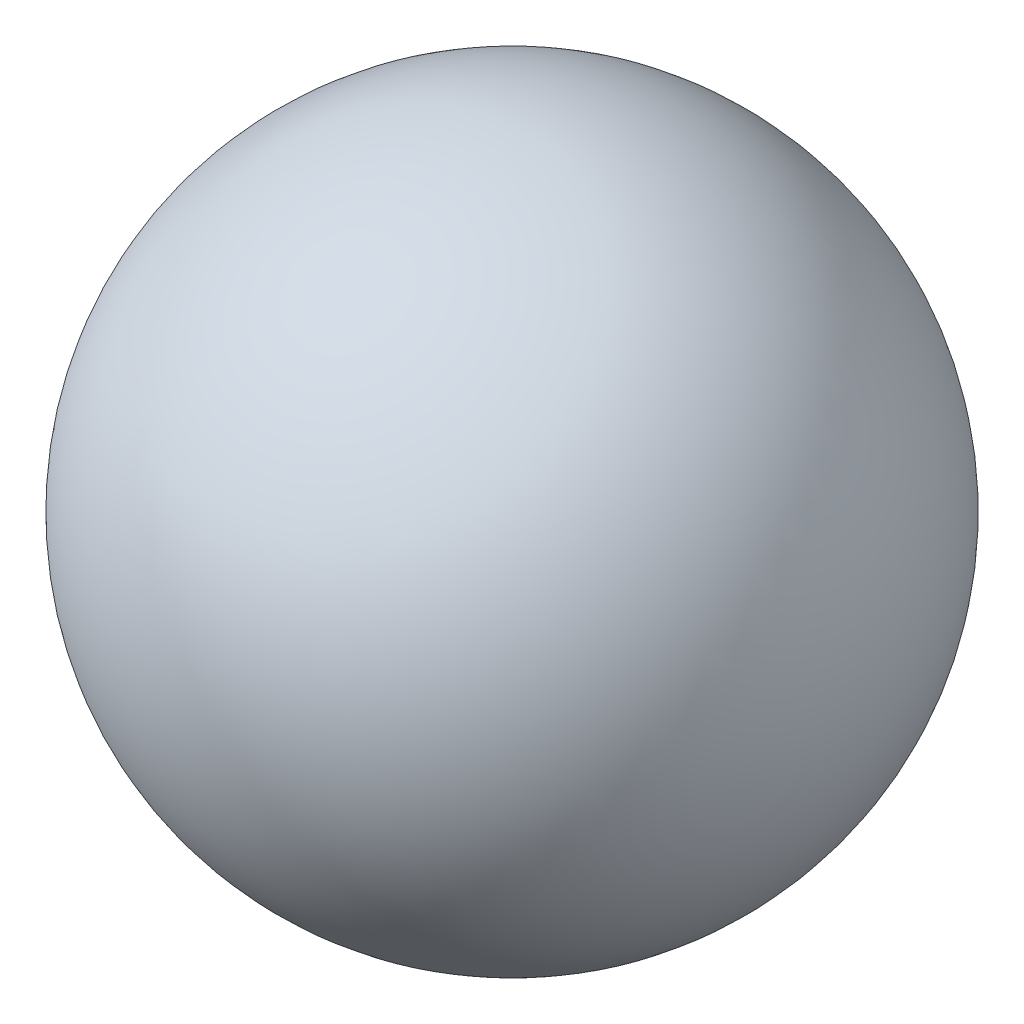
from build123d import *


with BuildPart() as part:
    # Esquisse1 → R_volution1 (revolve)
    with BuildSketch(Plane.XY):
        with BuildLine():
            Line((6.5, 18.3), (6.5, 10.2))
            ThreePointArc((6.5, 10.2), (2.45, 14.25), (6.5, 18.3))
        make_face()
    revolve(axis=Axis((6.5, 21, 0), (0, -1, 0)))


solid = part.part
